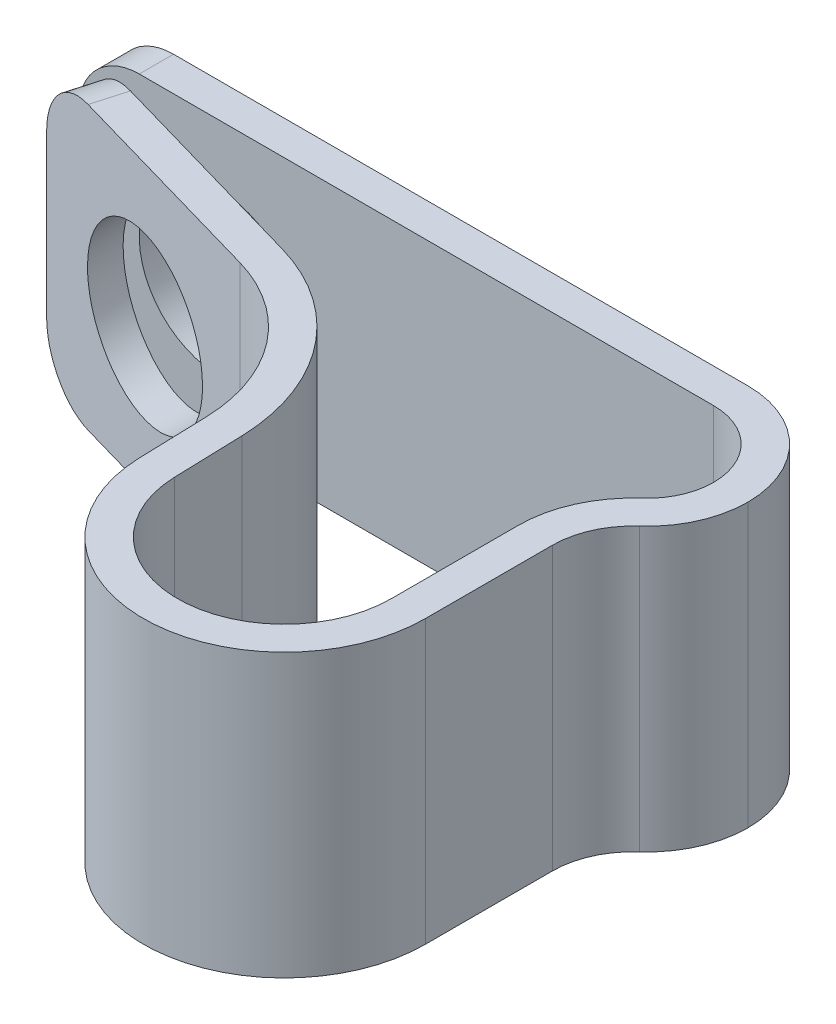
ISO-10303-21;
HEADER;
FILE_DESCRIPTION(('STEP AP214'),'2;1');
FILE_NAME('part.step','',(''),(''),'','','');
FILE_SCHEMA(('AUTOMOTIVE_DESIGN { 1 0 10303 214 1 1 1 1 }'));
ENDSEC;
DATA;
#1=APPLICATION_CONTEXT('core data for automotive mechanical design processes');
#2=APPLICATION_PROTOCOL_DEFINITION('international standard','automotive_design',2000,#1);
#3=PRODUCT_CONTEXT('',#1,'mechanical');
#4=PRODUCT('Part','Part','',(#3));
#5=PRODUCT_RELATED_PRODUCT_CATEGORY('part','',(#4));
#6=PRODUCT_DEFINITION_FORMATION('','',#4);
#7=PRODUCT_DEFINITION_CONTEXT('part definition',#1,'design');
#8=PRODUCT_DEFINITION('design','',#6,#7);
#9=PRODUCT_DEFINITION_SHAPE('','',#8);
#10=(LENGTH_UNIT() NAMED_UNIT(*) SI_UNIT(.MILLI.,.METRE.));
#11=(NAMED_UNIT(*) PLANE_ANGLE_UNIT() SI_UNIT($,.RADIAN.));
#12=(NAMED_UNIT(*) SI_UNIT($,.STERADIAN.) SOLID_ANGLE_UNIT());
#13=UNCERTAINTY_MEASURE_WITH_UNIT(LENGTH_MEASURE(1.E-05),#10,'distance_accuracy_value','');
#14=(GEOMETRIC_REPRESENTATION_CONTEXT(3) GLOBAL_UNCERTAINTY_ASSIGNED_CONTEXT((#13)) GLOBAL_UNIT_ASSIGNED_CONTEXT((#10,
#11,#12)) REPRESENTATION_CONTEXT('',''));
#15=CARTESIAN_POINT('',(0.,0.,0.));
#16=DIRECTION('',(0.,0.,1.));
#17=DIRECTION('',(1.,0.,0.));
#18=AXIS2_PLACEMENT_3D('',#15,#16,#17);
#19=CARTESIAN_POINT('',(-26.7541746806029,-46.2541746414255,1.59760957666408E-13));
#20=DIRECTION('',(1.,0.,0.));
#21=DIRECTION('',(0.,0.,-1.));
#22=AXIS2_PLACEMENT_3D('',#19,#20,#21);
#23=PLANE('',#22);
#24=DIRECTION('',(0.,-1.,0.));
#25=VECTOR('',#24,1.);
#26=CARTESIAN_POINT('',(-26.7541746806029,-46.2541746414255,0.850000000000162));
#27=LINE('',#26,#25);
#28=CARTESIAN_POINT('',(-26.7541746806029,-47.7541746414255,0.850000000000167));
#29=VERTEX_POINT('',#28);
#30=CARTESIAN_POINT('',(-26.7541746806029,-51.7541746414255,0.850000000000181));
#31=VERTEX_POINT('',#30);
#32=EDGE_CURVE('E208',#29,#31,#27,.T.);
#33=ORIENTED_EDGE('',*,*,#32,.F.);
#34=DIRECTION('',(0.,0.,1.));
#35=VECTOR('',#34,1.);
#36=CARTESIAN_POINT('',(-26.7541746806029,-47.7541746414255,1.64798730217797E-13));
#37=LINE('',#36,#35);
#38=CARTESIAN_POINT('',(-26.7541746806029,-47.7541746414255,1.64998182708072E-13));
#39=VERTEX_POINT('',#38);
#40=EDGE_CURVE('E49',#29,#39,#37,.F.);
#41=ORIENTED_EDGE('',*,*,#40,.T.);
#42=DIRECTION('',(0.,-1.,0.));
#43=VECTOR('',#42,1.);
#44=CARTESIAN_POINT('',(-26.7541746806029,-46.2541746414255,1.59760957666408E-13));
#45=LINE('',#44,#43);
#46=CARTESIAN_POINT('',(-26.7541746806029,-51.7541746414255,1.78964116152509E-13));
#47=VERTEX_POINT('',#46);
#48=EDGE_CURVE('E288',#39,#47,#45,.T.);
#49=ORIENTED_EDGE('',*,*,#48,.T.);
#50=DIRECTION('',(0.,0.,1.));
#51=VECTOR('',#50,1.);
#52=CARTESIAN_POINT('',(-26.7541746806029,-51.7541746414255,1.78964116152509E-13));
#53=LINE('',#52,#51);
#54=EDGE_CURVE('E366',#47,#31,#53,.T.);
#55=ORIENTED_EDGE('',*,*,#54,.T.);
#56=EDGE_LOOP('',(#33,#41,#49,#55));
#57=FACE_BOUND('',#56,.T.);
#58=ADVANCED_FACE('F29',(#57),#23,.F.);
#59=CARTESIAN_POINT('',(-26.7541746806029,-46.2541746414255,0.850000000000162));
#60=DIRECTION('',(0.,0.,-1.));
#61=DIRECTION('',(0.,1.,0.));
#62=AXIS2_PLACEMENT_3D('',#59,#60,#61);
#63=PLANE('',#62);
#64=CARTESIAN_POINT('',(-23.2541746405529,-49.7541746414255,0.850000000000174));
#65=DIRECTION('',(0.,0.,-1.));
#66=DIRECTION('',(0.,1.,0.));
#67=AXIS2_PLACEMENT_3D('',#64,#65,#66);
#68=CIRCLE('',#67,2.00000000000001);
#69=CARTESIAN_POINT('',(-23.2541746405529,-47.7541746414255,0.850000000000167));
#70=VERTEX_POINT('',#69);
#71=EDGE_CURVE('E201',#70,#70,#68,.T.);
#72=ORIENTED_EDGE('',*,*,#71,.T.);
#73=EDGE_LOOP('',(#72));
#74=FACE_BOUND('',#73,.T.);
#75=DIRECTION('',(1.,0.,0.));
#76=VECTOR('',#75,1.);
#77=CARTESIAN_POINT('',(-26.7541746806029,-46.2541746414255,0.850000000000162));
#78=LINE('',#77,#76);
#79=CARTESIAN_POINT('',(-25.2541746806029,-46.2541746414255,0.850000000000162));
#80=VERTEX_POINT('',#79);
#81=CARTESIAN_POINT('',(-11.0041746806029,-46.2541746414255,0.85000000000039));
#82=VERTEX_POINT('',#81);
#83=EDGE_CURVE('E251',#80,#82,#78,.T.);
#84=ORIENTED_EDGE('',*,*,#83,.F.);
#85=CARTESIAN_POINT('',(-25.2541746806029,-47.7541746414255,0.850000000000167));
#86=DIRECTION('',(0.,0.,-1.));
#87=DIRECTION('',(0.,1.,0.));
#88=AXIS2_PLACEMENT_3D('',#85,#86,#87);
#89=CIRCLE('',#88,1.5);
#90=EDGE_CURVE('E364',#80,#29,#89,.F.);
#91=ORIENTED_EDGE('',*,*,#90,.T.);
#92=ORIENTED_EDGE('',*,*,#32,.T.);
#93=CARTESIAN_POINT('',(-25.2541746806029,-51.7541746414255,0.850000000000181));
#94=DIRECTION('',(0.,0.,-1.));
#95=DIRECTION('',(0.,1.,0.));
#96=AXIS2_PLACEMENT_3D('',#93,#94,#95);
#97=CIRCLE('',#96,1.5);
#98=CARTESIAN_POINT('',(-25.2541746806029,-53.2541746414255,0.850000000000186));
#99=VERTEX_POINT('',#98);
#100=EDGE_CURVE('E196',#31,#99,#97,.F.);
#101=ORIENTED_EDGE('',*,*,#100,.T.);
#102=DIRECTION('',(1.,0.,0.));
#103=VECTOR('',#102,1.);
#104=CARTESIAN_POINT('',(-26.7541746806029,-53.2541746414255,0.850000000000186));
#105=LINE('',#104,#103);
#106=CARTESIAN_POINT('',(-11.0041746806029,-53.2541746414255,0.850000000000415));
#107=VERTEX_POINT('',#106);
#108=EDGE_CURVE('E189',#99,#107,#105,.T.);
#109=ORIENTED_EDGE('',*,*,#108,.T.);
#110=DIRECTION('',(0.,-1.,0.));
#111=VECTOR('',#110,1.);
#112=CARTESIAN_POINT('',(-11.0041746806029,-46.2541746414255,0.85000000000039));
#113=LINE('',#112,#111);
#114=EDGE_CURVE('E193',#82,#107,#113,.T.);
#115=ORIENTED_EDGE('',*,*,#114,.F.);
#116=EDGE_LOOP('',(#84,#91,#92,#101,#109,#115));
#117=FACE_BOUND('',#116,.T.);
#118=ADVANCED_FACE('F192',(#74,#117),#63,.F.);
#119=CARTESIAN_POINT('',(-11.0041746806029,-46.2541746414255,2.50000000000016));
#120=DIRECTION('',(0.,-1.,0.));
#121=DIRECTION('',(0.,0.,-1.));
#122=AXIS2_PLACEMENT_3D('',#119,#120,#121);
#123=CYLINDRICAL_SURFACE('',#122,1.64999999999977);
#124=CARTESIAN_POINT('',(-11.0041746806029,-53.2541746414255,2.50000000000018));
#125=DIRECTION('',(0.,-1.,0.));
#126=DIRECTION('',(0.,0.,1.));
#127=AXIS2_PLACEMENT_3D('',#124,#125,#126);
#128=CIRCLE('',#127,1.64999999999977);
#129=CARTESIAN_POINT('',(-9.35417468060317,-53.2541746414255,2.4999999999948));
#130=VERTEX_POINT('',#129);
#131=EDGE_CURVE('E200',#107,#130,#128,.T.);
#132=ORIENTED_EDGE('',*,*,#131,.T.);
#133=DIRECTION('',(0.,-1.,0.));
#134=VECTOR('',#133,1.);
#135=CARTESIAN_POINT('',(-9.35417468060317,-46.2541746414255,2.49999999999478));
#136=LINE('',#135,#134);
#137=CARTESIAN_POINT('',(-9.35417468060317,-46.2541746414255,2.49999999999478));
#138=VERTEX_POINT('',#137);
#139=EDGE_CURVE('E209',#138,#130,#136,.T.);
#140=ORIENTED_EDGE('',*,*,#139,.F.);
#141=CARTESIAN_POINT('',(-11.0041746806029,-46.2541746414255,2.50000000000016));
#142=DIRECTION('',(0.,-1.,0.));
#143=DIRECTION('',(0.,0.,1.));
#144=AXIS2_PLACEMENT_3D('',#141,#142,#143);
#145=CIRCLE('',#144,1.64999999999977);
#146=EDGE_CURVE('E207',#82,#138,#145,.T.);
#147=ORIENTED_EDGE('',*,*,#146,.F.);
#148=ORIENTED_EDGE('',*,*,#114,.T.);
#149=EDGE_LOOP('',(#132,#140,#147,#148));
#150=FACE_BOUND('',#149,.T.);
#151=ADVANCED_FACE('F204',(#150),#123,.F.);
#152=CARTESIAN_POINT('',(-11.0013269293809,-46.2541746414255,2.50000000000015));
#153=DIRECTION('',(0.,-1.,0.));
#154=DIRECTION('',(0.,0.,-1.));
#155=AXIS2_PLACEMENT_3D('',#152,#153,#154);
#156=CYLINDRICAL_SURFACE('',#155,1.64715224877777);
#157=CARTESIAN_POINT('',(-11.0013269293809,-53.2541746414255,2.50000000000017));
#158=DIRECTION('',(0.,-1.,0.));
#159=DIRECTION('',(0.,0.,-1.));
#160=AXIS2_PLACEMENT_3D('',#157,#158,#159);
#161=CIRCLE('',#160,1.64715224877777);
#162=CARTESIAN_POINT('',(-9.90357310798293,-53.2541746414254,3.72802568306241));
#163=VERTEX_POINT('',#162);
#164=EDGE_CURVE('E215',#130,#163,#161,.T.);
#165=ORIENTED_EDGE('',*,*,#164,.T.);
#166=DIRECTION('',(0.,-1.,0.));
#167=VECTOR('',#166,1.);
#168=CARTESIAN_POINT('',(-9.90357310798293,-46.2541746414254,3.72802568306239));
#169=LINE('',#168,#167);
#170=CARTESIAN_POINT('',(-9.90357310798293,-46.2541746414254,3.72802568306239));
#171=VERTEX_POINT('',#170);
#172=EDGE_CURVE('E335',#171,#163,#169,.T.);
#173=ORIENTED_EDGE('',*,*,#172,.F.);
#174=CARTESIAN_POINT('',(-11.0013269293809,-46.2541746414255,2.50000000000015));
#175=DIRECTION('',(0.,-1.,0.));
#176=DIRECTION('',(0.,0.,-1.));
#177=AXIS2_PLACEMENT_3D('',#174,#175,#176);
#178=CIRCLE('',#177,1.64715224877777);
#179=EDGE_CURVE('E254',#138,#171,#178,.T.);
#180=ORIENTED_EDGE('',*,*,#179,.F.);
#181=ORIENTED_EDGE('',*,*,#139,.T.);
#182=EDGE_LOOP('',(#165,#173,#180,#181));
#183=FACE_BOUND('',#182,.T.);
#184=ADVANCED_FACE('F406',(#183),#156,.F.);
#185=CARTESIAN_POINT('',(-8.00417468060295,-46.2541746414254,5.85282817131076));
#186=DIRECTION('',(0.,-1.,0.));
#187=DIRECTION('',(0.,0.,-1.));
#188=AXIS2_PLACEMENT_3D('',#185,#186,#187);
#189=CYLINDRICAL_SURFACE('',#188,2.85);
#190=CARTESIAN_POINT('',(-8.00417468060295,-53.2541746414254,5.85282817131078));
#191=DIRECTION('',(0.,1.,0.));
#192=DIRECTION('',(0.,0.,1.));
#193=AXIS2_PLACEMENT_3D('',#190,#191,#192);
#194=CIRCLE('',#193,2.85);
#195=CARTESIAN_POINT('',(-10.8541746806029,-53.2541746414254,5.85282817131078));
#196=VERTEX_POINT('',#195);
#197=EDGE_CURVE('E217',#163,#196,#194,.T.);
#198=ORIENTED_EDGE('',*,*,#197,.T.);
#199=DIRECTION('',(0.,-1.,0.));
#200=VECTOR('',#199,1.);
#201=CARTESIAN_POINT('',(-10.8541746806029,-46.2541746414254,5.85282817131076));
#202=LINE('',#201,#200);
#203=CARTESIAN_POINT('',(-10.8541746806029,-46.2541746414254,5.85282817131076));
#204=VERTEX_POINT('',#203);
#205=EDGE_CURVE('E332',#204,#196,#202,.T.);
#206=ORIENTED_EDGE('',*,*,#205,.F.);
#207=CARTESIAN_POINT('',(-8.00417468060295,-46.2541746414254,5.85282817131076));
#208=DIRECTION('',(0.,1.,0.));
#209=DIRECTION('',(0.,0.,1.));
#210=AXIS2_PLACEMENT_3D('',#207,#208,#209);
#211=CIRCLE('',#210,2.85);
#212=EDGE_CURVE('E256',#171,#204,#211,.T.);
#213=ORIENTED_EDGE('',*,*,#212,.F.);
#214=ORIENTED_EDGE('',*,*,#172,.T.);
#215=EDGE_LOOP('',(#198,#206,#213,#214));
#216=FACE_BOUND('',#215,.T.);
#217=ADVANCED_FACE('F412',(#216),#189,.T.);
#218=CARTESIAN_POINT('',(-10.8541746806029,-46.2541746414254,9.00000000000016));
#219=DIRECTION('',(1.,0.,0.));
#220=DIRECTION('',(0.,0.,-1.));
#221=AXIS2_PLACEMENT_3D('',#218,#219,#220);
#222=PLANE('',#221);
#223=DIRECTION('',(0.,0.,1.));
#224=VECTOR('',#223,1.);
#225=CARTESIAN_POINT('',(-10.8541746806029,-53.2541746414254,9.00000000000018));
#226=LINE('',#225,#224);
#227=CARTESIAN_POINT('',(-10.8541746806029,-53.2541746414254,9.00000000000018));
#228=VERTEX_POINT('',#227);
#229=EDGE_CURVE('E222',#196,#228,#226,.T.);
#230=ORIENTED_EDGE('',*,*,#229,.T.);
#231=DIRECTION('',(0.,-1.,0.));
#232=VECTOR('',#231,1.);
#233=CARTESIAN_POINT('',(-10.8541746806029,-46.2541746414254,9.00000000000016));
#234=LINE('',#233,#232);
#235=CARTESIAN_POINT('',(-10.8541746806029,-46.2541746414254,9.00000000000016));
#236=VERTEX_POINT('',#235);
#237=EDGE_CURVE('E329',#236,#228,#234,.T.);
#238=ORIENTED_EDGE('',*,*,#237,.F.);
#239=DIRECTION('',(0.,0.,1.));
#240=VECTOR('',#239,1.);
#241=CARTESIAN_POINT('',(-10.8541746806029,-46.2541746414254,9.00000000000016));
#242=LINE('',#241,#240);
#243=EDGE_CURVE('E258',#204,#236,#242,.T.);
#244=ORIENTED_EDGE('',*,*,#243,.F.);
#245=ORIENTED_EDGE('',*,*,#205,.T.);
#246=EDGE_LOOP('',(#230,#238,#244,#245));
#247=FACE_BOUND('',#246,.T.);
#248=ADVANCED_FACE('F416',(#247),#222,.F.);
#249=CARTESIAN_POINT('',(-13.5041746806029,-46.2541746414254,9.00000000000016));
#250=DIRECTION('',(0.,-1.,0.));
#251=DIRECTION('',(0.,0.,-1.));
#252=AXIS2_PLACEMENT_3D('',#249,#250,#251);
#253=CYLINDRICAL_SURFACE('',#252,2.65);
#254=CARTESIAN_POINT('',(-13.5041746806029,-53.2541746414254,9.00000000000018));
#255=DIRECTION('',(0.,-1.,0.));
#256=DIRECTION('',(0.,0.,1.));
#257=AXIS2_PLACEMENT_3D('',#254,#255,#256);
#258=CIRCLE('',#257,2.65);
#259=CARTESIAN_POINT('',(-16.1529071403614,-53.2541746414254,9.08195338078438));
#260=VERTEX_POINT('',#259);
#261=EDGE_CURVE('E224',#228,#260,#258,.T.);
#262=ORIENTED_EDGE('',*,*,#261,.T.);
#263=DIRECTION('',(0.,-1.,0.));
#264=VECTOR('',#263,1.);
#265=CARTESIAN_POINT('',(-16.1529071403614,-46.2541746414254,9.08195338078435));
#266=LINE('',#265,#264);
#267=CARTESIAN_POINT('',(-16.1529071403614,-46.2541746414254,9.08195338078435));
#268=VERTEX_POINT('',#267);
#269=EDGE_CURVE('E326',#268,#260,#266,.T.);
#270=ORIENTED_EDGE('',*,*,#269,.F.);
#271=CARTESIAN_POINT('',(-13.5041746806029,-46.2541746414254,9.00000000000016));
#272=DIRECTION('',(0.,-1.,0.));
#273=DIRECTION('',(0.,0.,1.));
#274=AXIS2_PLACEMENT_3D('',#271,#272,#273);
#275=CIRCLE('',#274,2.65);
#276=EDGE_CURVE('E260',#236,#268,#275,.T.);
#277=ORIENTED_EDGE('',*,*,#276,.F.);
#278=ORIENTED_EDGE('',*,*,#237,.T.);
#279=EDGE_LOOP('',(#262,#270,#277,#278));
#280=FACE_BOUND('',#279,.T.);
#281=ADVANCED_FACE('F420',(#280),#253,.F.);
#282=CARTESIAN_POINT('',(-16.1529071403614,-46.2541746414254,9.08195338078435));
#283=DIRECTION('',(-0.999521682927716,0.,0.0309258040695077));
#284=DIRECTION('',(0.0309258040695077,0.,0.999521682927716));
#285=AXIS2_PLACEMENT_3D('',#282,#283,#284);
#286=PLANE('',#285);
#287=DIRECTION('',(-0.0309258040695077,0.,-0.999521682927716));
#288=VECTOR('',#287,1.);
#289=CARTESIAN_POINT('',(-16.1529071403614,-53.2541746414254,9.08195338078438));
#290=LINE('',#289,#288);
#291=CARTESIAN_POINT('',(-16.2064945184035,-53.2541746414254,7.35000985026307));
#292=VERTEX_POINT('',#291);
#293=EDGE_CURVE('E226',#260,#292,#290,.T.);
#294=ORIENTED_EDGE('',*,*,#293,.T.);
#295=DIRECTION('',(0.,-1.,0.));
#296=VECTOR('',#295,1.);
#297=CARTESIAN_POINT('',(-16.2064945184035,-46.2541746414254,7.35000985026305));
#298=LINE('',#297,#296);
#299=CARTESIAN_POINT('',(-16.2064945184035,-46.2541746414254,7.35000985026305));
#300=VERTEX_POINT('',#299);
#301=EDGE_CURVE('E323',#300,#292,#298,.T.);
#302=ORIENTED_EDGE('',*,*,#301,.F.);
#303=DIRECTION('',(-0.0309258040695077,0.,-0.999521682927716));
#304=VECTOR('',#303,1.);
#305=CARTESIAN_POINT('',(-16.1529071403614,-46.2541746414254,9.08195338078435));
#306=LINE('',#305,#304);
#307=EDGE_CURVE('E262',#268,#300,#306,.T.);
#308=ORIENTED_EDGE('',*,*,#307,.F.);
#309=ORIENTED_EDGE('',*,*,#269,.T.);
#310=EDGE_LOOP('',(#294,#302,#308,#309));
#311=FACE_BOUND('',#310,.T.);
#312=ADVANCED_FACE('F424',(#311),#286,.F.);
#313=CARTESIAN_POINT('',(-21.0541746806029,-46.2541746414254,7.50000000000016));
#314=DIRECTION('',(0.,-1.,0.));
#315=DIRECTION('',(0.,0.,-1.));
#316=AXIS2_PLACEMENT_3D('',#313,#314,#315);
#317=CYLINDRICAL_SURFACE('',#316,4.85);
#318=CARTESIAN_POINT('',(-21.0541746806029,-53.2541746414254,7.50000000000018));
#319=DIRECTION('',(0.,1.,0.));
#320=DIRECTION('',(0.,0.,1.));
#321=AXIS2_PLACEMENT_3D('',#318,#319,#320);
#322=CIRCLE('',#321,4.85);
#323=CARTESIAN_POINT('',(-19.7173335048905,-53.2541746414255,2.83788077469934));
#324=VERTEX_POINT('',#323);
#325=EDGE_CURVE('E228',#292,#324,#322,.T.);
#326=ORIENTED_EDGE('',*,*,#325,.T.);
#327=DIRECTION('',(0.,-1.,0.));
#328=VECTOR('',#327,1.);
#329=CARTESIAN_POINT('',(-19.7173335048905,-46.2541746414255,2.83788077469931));
#330=LINE('',#329,#328);
#331=CARTESIAN_POINT('',(-19.7173335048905,-46.2541746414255,2.83788077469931));
#332=VERTEX_POINT('',#331);
#333=EDGE_CURVE('E320',#332,#324,#330,.T.);
#334=ORIENTED_EDGE('',*,*,#333,.F.);
#335=CARTESIAN_POINT('',(-21.0541746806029,-46.2541746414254,7.50000000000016));
#336=DIRECTION('',(0.,1.,0.));
#337=DIRECTION('',(0.,0.,1.));
#338=AXIS2_PLACEMENT_3D('',#335,#336,#337);
#339=CIRCLE('',#338,4.85);
#340=EDGE_CURVE('E264',#300,#332,#339,.T.);
#341=ORIENTED_EDGE('',*,*,#340,.F.);
#342=ORIENTED_EDGE('',*,*,#301,.T.);
#343=EDGE_LOOP('',(#326,#334,#341,#342));
#344=FACE_BOUND('',#343,.T.);
#345=ADVANCED_FACE('F428',(#344),#317,.T.);
#346=CARTESIAN_POINT('',(-19.7173335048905,-46.2541746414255,2.83788077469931));
#347=DIRECTION('',(-0.275637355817,0.,0.961261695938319));
#348=DIRECTION('',(0.961261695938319,0.,0.275637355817));
#349=AXIS2_PLACEMENT_3D('',#346,#347,#348);
#350=PLANE('',#349);
#351=CARTESIAN_POINT('',(-23.2541746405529,-49.7541746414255,1.82370789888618));
#352=DIRECTION('',(-0.275637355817,0.,0.961261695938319));
#353=DIRECTION('',(-0.961261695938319,0.,-0.275637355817));
#354=AXIS2_PLACEMENT_3D('',#351,#352,#353);
#355=ELLIPSE('',#354,2.08059887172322,2.00000000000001);
#356=CARTESIAN_POINT('',(-25.2541746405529,-49.7541746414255,1.25021712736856));
#357=VERTEX_POINT('',#356);
#358=EDGE_CURVE('E568',#357,#357,#355,.T.);
#359=ORIENTED_EDGE('',*,*,#358,.T.);
#360=EDGE_LOOP('',(#359));
#361=FACE_BOUND('',#360,.T.);
#362=DIRECTION('',(-0.961261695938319,0.,-0.275637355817));
#363=VECTOR('',#362,1.);
#364=CARTESIAN_POINT('',(-19.7173335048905,-53.2541746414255,2.83788077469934));
#365=LINE('',#364,#363);
#366=CARTESIAN_POINT('',(-24.999792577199,-53.2541746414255,1.3231600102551));
#367=VERTEX_POINT('',#366);
#368=EDGE_CURVE('E230',#324,#367,#365,.T.);
#369=ORIENTED_EDGE('',*,*,#368,.T.);
#370=CARTESIAN_POINT('',(-24.999792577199,-51.7541746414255,1.3231600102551));
#371=DIRECTION('',(-0.275637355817,0.,0.961261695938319));
#372=DIRECTION('',(0.961261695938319,0.,0.275637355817));
#373=AXIS2_PLACEMENT_3D('',#370,#371,#372);
#374=CIRCLE('',#373,1.5);
#375=CARTESIAN_POINT('',(-26.4416851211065,-51.7541746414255,0.909703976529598));
#376=VERTEX_POINT('',#375);
#377=EDGE_CURVE('E355',#367,#376,#374,.F.);
#378=ORIENTED_EDGE('',*,*,#377,.T.);
#379=DIRECTION('',(0.,-1.,0.));
#380=VECTOR('',#379,1.);
#381=CARTESIAN_POINT('',(-26.4416851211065,-46.2541746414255,0.909703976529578));
#382=LINE('',#381,#380);
#383=CARTESIAN_POINT('',(-26.4416851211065,-47.7541746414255,0.909703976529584));
#384=VERTEX_POINT('',#383);
#385=EDGE_CURVE('E317',#384,#376,#382,.T.);
#386=ORIENTED_EDGE('',*,*,#385,.F.);
#387=CARTESIAN_POINT('',(-24.999792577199,-47.7541746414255,1.32316001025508));
#388=DIRECTION('',(-0.275637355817,0.,0.961261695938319));
#389=DIRECTION('',(0.961261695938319,0.,0.275637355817));
#390=AXIS2_PLACEMENT_3D('',#387,#388,#389);
#391=CIRCLE('',#390,1.5);
#392=CARTESIAN_POINT('',(-24.999792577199,-46.2541746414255,1.32316001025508));
#393=VERTEX_POINT('',#392);
#394=EDGE_CURVE('E353',#384,#393,#391,.F.);
#395=ORIENTED_EDGE('',*,*,#394,.T.);
#396=DIRECTION('',(-0.961261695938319,0.,-0.275637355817));
#397=VECTOR('',#396,1.);
#398=CARTESIAN_POINT('',(-19.7173335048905,-46.2541746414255,2.83788077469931));
#399=LINE('',#398,#397);
#400=EDGE_CURVE('E266',#332,#393,#399,.T.);
#401=ORIENTED_EDGE('',*,*,#400,.F.);
#402=ORIENTED_EDGE('',*,*,#333,.T.);
#403=EDGE_LOOP('',(#369,#378,#386,#395,#401,#402));
#404=FACE_BOUND('',#403,.T.);
#405=ADVANCED_FACE('F432',(#361,#404),#350,.F.);
#406=CARTESIAN_POINT('',(-26.4416851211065,-46.2541746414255,0.909703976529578));
#407=DIRECTION('',(0.961261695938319,0.,0.275637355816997));
#408=DIRECTION('',(0.275637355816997,0.,-0.96126169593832));
#409=AXIS2_PLACEMENT_3D('',#406,#407,#408);
#410=PLANE('',#409);
#411=ORIENTED_EDGE('',*,*,#385,.T.);
#412=DIRECTION('',(-0.275637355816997,0.,0.96126169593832));
#413=VECTOR('',#412,1.);
#414=CARTESIAN_POINT('',(-26.4416851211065,-51.7541746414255,0.909703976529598));
#415=LINE('',#414,#413);
#416=CARTESIAN_POINT('',(-26.675976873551,-51.7541746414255,1.72677641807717));
#417=VERTEX_POINT('',#416);
#418=EDGE_CURVE('E342',#376,#417,#415,.T.);
#419=ORIENTED_EDGE('',*,*,#418,.T.);
#420=DIRECTION('',(0.,-1.,0.));
#421=VECTOR('',#420,1.);
#422=CARTESIAN_POINT('',(-26.675976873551,-46.2541746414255,1.72677641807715));
#423=LINE('',#422,#421);
#424=CARTESIAN_POINT('',(-26.675976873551,-47.7541746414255,1.72677641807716));
#425=VERTEX_POINT('',#424);
#426=EDGE_CURVE('E314',#425,#417,#423,.T.);
#427=ORIENTED_EDGE('',*,*,#426,.F.);
#428=DIRECTION('',(-0.275637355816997,0.,0.96126169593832));
#429=VECTOR('',#428,1.);
#430=CARTESIAN_POINT('',(-26.4416851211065,-47.7541746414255,0.909703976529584));
#431=LINE('',#430,#429);
#432=EDGE_CURVE('E340',#425,#384,#431,.F.);
#433=ORIENTED_EDGE('',*,*,#432,.T.);
#434=EDGE_LOOP('',(#411,#419,#427,#433));
#435=FACE_BOUND('',#434,.T.);
#436=ADVANCED_FACE('F436',(#435),#410,.F.);
#437=CARTESIAN_POINT('',(-26.675976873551,-46.2541746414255,1.72677641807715));
#438=DIRECTION('',(0.275637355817,0.,-0.961261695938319));
#439=DIRECTION('',(-0.961261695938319,0.,-0.275637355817));
#440=AXIS2_PLACEMENT_3D('',#437,#438,#439);
#441=PLANE('',#440);
#442=CARTESIAN_POINT('',(-23.2541746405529,-49.7541746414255,2.70796241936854));
#443=DIRECTION('',(0.275637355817,0.,-0.961261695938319));
#444=DIRECTION('',(-0.961261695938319,0.,-0.275637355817));
#445=AXIS2_PLACEMENT_3D('',#442,#443,#444);
#446=ELLIPSE('',#445,2.08059887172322,2.00000000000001);
#447=CARTESIAN_POINT('',(-25.2541746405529,-49.7541746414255,2.13447164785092));
#448=VERTEX_POINT('',#447);
#449=EDGE_CURVE('E565',#448,#448,#446,.T.);
#450=ORIENTED_EDGE('',*,*,#449,.T.);
#451=EDGE_LOOP('',(#450));
#452=FACE_BOUND('',#451,.T.);
#453=ORIENTED_EDGE('',*,*,#426,.T.);
#454=CARTESIAN_POINT('',(-25.2340843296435,-51.7541746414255,2.14023245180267));
#455=DIRECTION('',(0.275637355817,0.,-0.961261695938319));
#456=DIRECTION('',(-0.961261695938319,0.,-0.275637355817));
#457=AXIS2_PLACEMENT_3D('',#454,#455,#456);
#458=CIRCLE('',#457,1.5);
#459=CARTESIAN_POINT('',(-25.2340843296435,-53.2541746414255,2.14023245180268));
#460=VERTEX_POINT('',#459);
#461=EDGE_CURVE('E347',#417,#460,#458,.F.);
#462=ORIENTED_EDGE('',*,*,#461,.T.);
#463=DIRECTION('',(0.961261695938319,0.,0.275637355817));
#464=VECTOR('',#463,1.);
#465=CARTESIAN_POINT('',(-26.675976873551,-53.2541746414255,1.72677641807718));
#466=LINE('',#465,#464);
#467=CARTESIAN_POINT('',(-19.9516252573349,-53.2541746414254,3.65495321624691));
#468=VERTEX_POINT('',#467);
#469=EDGE_CURVE('E233',#460,#468,#466,.T.);
#470=ORIENTED_EDGE('',*,*,#469,.T.);
#471=DIRECTION('',(0.,-1.,0.));
#472=VECTOR('',#471,1.);
#473=CARTESIAN_POINT('',(-19.9516252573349,-46.2541746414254,3.65495321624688));
#474=LINE('',#473,#472);
#475=CARTESIAN_POINT('',(-19.9516252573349,-46.2541746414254,3.65495321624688));
#476=VERTEX_POINT('',#475);
#477=EDGE_CURVE('E311',#476,#468,#474,.T.);
#478=ORIENTED_EDGE('',*,*,#477,.F.);
#479=DIRECTION('',(0.961261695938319,0.,0.275637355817));
#480=VECTOR('',#479,1.);
#481=CARTESIAN_POINT('',(-26.675976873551,-46.2541746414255,1.72677641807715));
#482=LINE('',#481,#480);
#483=CARTESIAN_POINT('',(-25.2340843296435,-46.2541746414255,2.14023245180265));
#484=VERTEX_POINT('',#483);
#485=EDGE_CURVE('E269',#484,#476,#482,.T.);
#486=ORIENTED_EDGE('',*,*,#485,.F.);
#487=CARTESIAN_POINT('',(-25.2340843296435,-47.7541746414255,2.14023245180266));
#488=DIRECTION('',(0.275637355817,0.,-0.961261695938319));
#489=DIRECTION('',(-0.961261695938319,0.,-0.275637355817));
#490=AXIS2_PLACEMENT_3D('',#487,#488,#489);
#491=CIRCLE('',#490,1.5);
#492=EDGE_CURVE('E345',#484,#425,#491,.F.);
#493=ORIENTED_EDGE('',*,*,#492,.T.);
#494=EDGE_LOOP('',(#453,#462,#470,#478,#486,#493));
#495=FACE_BOUND('',#494,.T.);
#496=ADVANCED_FACE('F440',(#452,#495),#441,.F.);
#497=CARTESIAN_POINT('',(-21.0541746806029,-46.2541746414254,7.50000000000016));
#498=DIRECTION('',(0.,-1.,0.));
#499=DIRECTION('',(0.,0.,-1.));
#500=AXIS2_PLACEMENT_3D('',#497,#498,#499);
#501=CYLINDRICAL_SURFACE('',#500,4.);
#502=CARTESIAN_POINT('',(-21.0541746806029,-53.2541746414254,7.50000000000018));
#503=DIRECTION('',(0.,-1.,0.));
#504=DIRECTION('',(0.,0.,1.));
#505=AXIS2_PLACEMENT_3D('',#502,#503,#504);
#506=CIRCLE('',#505,4.);
#507=CARTESIAN_POINT('',(-17.0560879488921,-53.2541746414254,7.37629678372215));
#508=VERTEX_POINT('',#507);
#509=EDGE_CURVE('E235',#468,#508,#506,.T.);
#510=ORIENTED_EDGE('',*,*,#509,.T.);
#511=DIRECTION('',(0.,-1.,0.));
#512=VECTOR('',#511,1.);
#513=CARTESIAN_POINT('',(-17.0560879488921,-46.2541746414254,7.37629678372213));
#514=LINE('',#513,#512);
#515=CARTESIAN_POINT('',(-17.0560879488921,-46.2541746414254,7.37629678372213));
#516=VERTEX_POINT('',#515);
#517=EDGE_CURVE('E308',#516,#508,#514,.T.);
#518=ORIENTED_EDGE('',*,*,#517,.F.);
#519=CARTESIAN_POINT('',(-21.0541746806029,-46.2541746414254,7.50000000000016));
#520=DIRECTION('',(0.,-1.,0.));
#521=DIRECTION('',(0.,0.,1.));
#522=AXIS2_PLACEMENT_3D('',#519,#520,#521);
#523=CIRCLE('',#522,4.);
#524=EDGE_CURVE('E271',#476,#516,#523,.T.);
#525=ORIENTED_EDGE('',*,*,#524,.F.);
#526=ORIENTED_EDGE('',*,*,#477,.T.);
#527=EDGE_LOOP('',(#510,#518,#525,#526));
#528=FACE_BOUND('',#527,.T.);
#529=ADVANCED_FACE('F444',(#528),#501,.F.);
#530=CARTESIAN_POINT('',(-17.0025005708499,-46.2541746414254,9.10824031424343));
#531=DIRECTION('',(0.999521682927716,0.,-0.0309258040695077));
#532=DIRECTION('',(-0.0309258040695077,0.,-0.999521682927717));
#533=AXIS2_PLACEMENT_3D('',#530,#531,#532);
#534=PLANE('',#533);
#535=DIRECTION('',(0.0309258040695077,0.,0.999521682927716));
#536=VECTOR('',#535,1.);
#537=CARTESIAN_POINT('',(-17.0025005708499,-53.2541746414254,9.10824031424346));
#538=LINE('',#537,#536);
#539=CARTESIAN_POINT('',(-17.0025005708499,-53.2541746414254,9.10824031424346));
#540=VERTEX_POINT('',#539);
#541=EDGE_CURVE('E237',#508,#540,#538,.T.);
#542=ORIENTED_EDGE('',*,*,#541,.T.);
#543=DIRECTION('',(0.,-1.,0.));
#544=VECTOR('',#543,1.);
#545=CARTESIAN_POINT('',(-17.0025005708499,-46.2541746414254,9.10824031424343));
#546=LINE('',#545,#544);
#547=CARTESIAN_POINT('',(-17.0025005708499,-46.2541746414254,9.10824031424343));
#548=VERTEX_POINT('',#547);
#549=EDGE_CURVE('E305',#548,#540,#546,.T.);
#550=ORIENTED_EDGE('',*,*,#549,.F.);
#551=DIRECTION('',(0.0309258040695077,0.,0.999521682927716));
#552=VECTOR('',#551,1.);
#553=CARTESIAN_POINT('',(-17.0025005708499,-46.2541746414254,9.10824031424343));
#554=LINE('',#553,#552);
#555=EDGE_CURVE('E273',#516,#548,#554,.T.);
#556=ORIENTED_EDGE('',*,*,#555,.F.);
#557=ORIENTED_EDGE('',*,*,#517,.T.);
#558=EDGE_LOOP('',(#542,#550,#556,#557));
#559=FACE_BOUND('',#558,.T.);
#560=ADVANCED_FACE('F448',(#559),#534,.F.);
#561=CARTESIAN_POINT('',(-13.5041746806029,-46.2541746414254,9.00000000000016));
#562=DIRECTION('',(0.,-1.,0.));
#563=DIRECTION('',(0.,0.,-1.));
#564=AXIS2_PLACEMENT_3D('',#561,#562,#563);
#565=CYLINDRICAL_SURFACE('',#564,3.5);
#566=CARTESIAN_POINT('',(-13.5041746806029,-53.2541746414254,9.00000000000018));
#567=DIRECTION('',(0.,1.,0.));
#568=DIRECTION('',(0.,0.,1.));
#569=AXIS2_PLACEMENT_3D('',#566,#567,#568);
#570=CIRCLE('',#569,3.5);
#571=CARTESIAN_POINT('',(-10.0041746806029,-53.2541746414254,9.00000000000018));
#572=VERTEX_POINT('',#571);
#573=EDGE_CURVE('E239',#540,#572,#570,.T.);
#574=ORIENTED_EDGE('',*,*,#573,.T.);
#575=DIRECTION('',(0.,-1.,0.));
#576=VECTOR('',#575,1.);
#577=CARTESIAN_POINT('',(-10.0041746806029,-46.2541746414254,9.00000000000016));
#578=LINE('',#577,#576);
#579=CARTESIAN_POINT('',(-10.0041746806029,-46.2541746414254,9.00000000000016));
#580=VERTEX_POINT('',#579);
#581=EDGE_CURVE('E302',#580,#572,#578,.T.);
#582=ORIENTED_EDGE('',*,*,#581,.F.);
#583=CARTESIAN_POINT('',(-13.5041746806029,-46.2541746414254,9.00000000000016));
#584=DIRECTION('',(0.,1.,0.));
#585=DIRECTION('',(0.,0.,1.));
#586=AXIS2_PLACEMENT_3D('',#583,#584,#585);
#587=CIRCLE('',#586,3.5);
#588=EDGE_CURVE('E275',#548,#580,#587,.T.);
#589=ORIENTED_EDGE('',*,*,#588,.F.);
#590=ORIENTED_EDGE('',*,*,#549,.T.);
#591=EDGE_LOOP('',(#574,#582,#589,#590));
#592=FACE_BOUND('',#591,.T.);
#593=ADVANCED_FACE('F452',(#592),#565,.T.);
#594=CARTESIAN_POINT('',(-10.0041746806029,-46.2541746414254,9.00000000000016));
#595=DIRECTION('',(-1.,0.,0.));
#596=DIRECTION('',(0.,0.,1.));
#597=AXIS2_PLACEMENT_3D('',#594,#595,#596);
#598=PLANE('',#597);
#599=DIRECTION('',(0.,0.,-1.));
#600=VECTOR('',#599,1.);
#601=CARTESIAN_POINT('',(-10.0041746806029,-53.2541746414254,9.00000000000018));
#602=LINE('',#601,#600);
#603=CARTESIAN_POINT('',(-10.0041746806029,-53.2541746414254,5.85282817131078));
#604=VERTEX_POINT('',#603);
#605=EDGE_CURVE('E241',#572,#604,#602,.T.);
#606=ORIENTED_EDGE('',*,*,#605,.T.);
#607=DIRECTION('',(0.,-1.,0.));
#608=VECTOR('',#607,1.);
#609=CARTESIAN_POINT('',(-10.0041746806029,-46.2541746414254,5.85282817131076));
#610=LINE('',#609,#608);
#611=CARTESIAN_POINT('',(-10.0041746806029,-46.2541746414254,5.85282817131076));
#612=VERTEX_POINT('',#611);
#613=EDGE_CURVE('E299',#612,#604,#610,.T.);
#614=ORIENTED_EDGE('',*,*,#613,.F.);
#615=DIRECTION('',(0.,0.,-1.));
#616=VECTOR('',#615,1.);
#617=CARTESIAN_POINT('',(-10.0041746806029,-46.2541746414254,9.00000000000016));
#618=LINE('',#617,#616);
#619=EDGE_CURVE('E277',#580,#612,#618,.T.);
#620=ORIENTED_EDGE('',*,*,#619,.F.);
#621=ORIENTED_EDGE('',*,*,#581,.T.);
#622=EDGE_LOOP('',(#606,#614,#620,#621));
#623=FACE_BOUND('',#622,.T.);
#624=ADVANCED_FACE('F456',(#623),#598,.F.);
#625=CARTESIAN_POINT('',(-8.00417468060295,-46.2541746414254,5.85282817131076));
#626=DIRECTION('',(0.,-1.,0.));
#627=DIRECTION('',(0.,0.,-1.));
#628=AXIS2_PLACEMENT_3D('',#625,#626,#627);
#629=CYLINDRICAL_SURFACE('',#628,2.);
#630=CARTESIAN_POINT('',(-8.00417468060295,-53.2541746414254,5.85282817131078));
#631=DIRECTION('',(0.,-1.,0.));
#632=DIRECTION('',(0.,0.,1.));
#633=AXIS2_PLACEMENT_3D('',#630,#631,#632);
#634=CIRCLE('',#633,2.);
#635=CARTESIAN_POINT('',(-9.33708585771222,-53.2541746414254,4.36173870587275));
#636=VERTEX_POINT('',#635);
#637=EDGE_CURVE('E243',#604,#636,#634,.T.);
#638=ORIENTED_EDGE('',*,*,#637,.T.);
#639=DIRECTION('',(0.,-1.,0.));
#640=VECTOR('',#639,1.);
#641=CARTESIAN_POINT('',(-9.33708585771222,-46.2541746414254,4.36173870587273));
#642=LINE('',#641,#640);
#643=CARTESIAN_POINT('',(-9.33708585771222,-46.2541746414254,4.36173870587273));
#644=VERTEX_POINT('',#643);
#645=EDGE_CURVE('E296',#644,#636,#642,.T.);
#646=ORIENTED_EDGE('',*,*,#645,.F.);
#647=CARTESIAN_POINT('',(-8.00417468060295,-46.2541746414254,5.85282817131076));
#648=DIRECTION('',(0.,-1.,0.));
#649=DIRECTION('',(0.,0.,1.));
#650=AXIS2_PLACEMENT_3D('',#647,#648,#649);
#651=CIRCLE('',#650,2.);
#652=EDGE_CURVE('E279',#612,#644,#651,.T.);
#653=ORIENTED_EDGE('',*,*,#652,.F.);
#654=ORIENTED_EDGE('',*,*,#613,.T.);
#655=EDGE_LOOP('',(#638,#646,#653,#654));
#656=FACE_BOUND('',#655,.T.);
#657=ADVANCED_FACE('F460',(#656),#629,.F.);
#658=CARTESIAN_POINT('',(-11.0013269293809,-46.2541746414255,2.50000000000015));
#659=DIRECTION('',(0.,-1.,0.));
#660=DIRECTION('',(0.,0.,-1.));
#661=AXIS2_PLACEMENT_3D('',#658,#659,#660);
#662=CYLINDRICAL_SURFACE('',#661,2.49715224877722);
#663=CARTESIAN_POINT('',(-11.0013269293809,-53.2541746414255,2.50000000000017));
#664=DIRECTION('',(0.,1.,0.));
#665=DIRECTION('',(0.,0.,-1.));
#666=AXIS2_PLACEMENT_3D('',#663,#664,#665);
#667=CIRCLE('',#666,2.49715224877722);
#668=CARTESIAN_POINT('',(-8.50417468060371,-53.2541746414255,2.4999999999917));
#669=VERTEX_POINT('',#668);
#670=EDGE_CURVE('E245',#636,#669,#667,.T.);
#671=ORIENTED_EDGE('',*,*,#670,.T.);
#672=DIRECTION('',(0.,-1.,0.));
#673=VECTOR('',#672,1.);
#674=CARTESIAN_POINT('',(-8.50417468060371,-46.2541746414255,2.49999999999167));
#675=LINE('',#674,#673);
#676=CARTESIAN_POINT('',(-8.50417468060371,-46.2541746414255,2.49999999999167));
#677=VERTEX_POINT('',#676);
#678=EDGE_CURVE('E293',#677,#669,#675,.T.);
#679=ORIENTED_EDGE('',*,*,#678,.F.);
#680=CARTESIAN_POINT('',(-11.0013269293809,-46.2541746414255,2.50000000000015));
#681=DIRECTION('',(0.,1.,0.));
#682=DIRECTION('',(0.,0.,-1.));
#683=AXIS2_PLACEMENT_3D('',#680,#681,#682);
#684=CIRCLE('',#683,2.49715224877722);
#685=EDGE_CURVE('E281',#644,#677,#684,.T.);
#686=ORIENTED_EDGE('',*,*,#685,.F.);
#687=ORIENTED_EDGE('',*,*,#645,.T.);
#688=EDGE_LOOP('',(#671,#679,#686,#687));
#689=FACE_BOUND('',#688,.T.);
#690=ADVANCED_FACE('F464',(#689),#662,.T.);
#691=CARTESIAN_POINT('',(-11.0041746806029,-46.2541746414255,2.50000000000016));
#692=DIRECTION('',(0.,-1.,0.));
#693=DIRECTION('',(0.,0.,-1.));
#694=AXIS2_PLACEMENT_3D('',#691,#692,#693);
#695=CYLINDRICAL_SURFACE('',#694,2.49999999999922);
#696=CARTESIAN_POINT('',(-11.0041746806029,-53.2541746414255,2.50000000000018));
#697=DIRECTION('',(0.,1.,0.));
#698=DIRECTION('',(0.,0.,1.));
#699=AXIS2_PLACEMENT_3D('',#696,#697,#698);
#700=CIRCLE('',#699,2.49999999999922);
#701=CARTESIAN_POINT('',(-11.0041746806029,-53.2541746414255,1.82466617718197E-13));
#702=VERTEX_POINT('',#701);
#703=EDGE_CURVE('E247',#669,#702,#700,.T.);
#704=ORIENTED_EDGE('',*,*,#703,.T.);
#705=DIRECTION('',(0.,-1.,0.));
#706=VECTOR('',#705,1.);
#707=CARTESIAN_POINT('',(-11.0041746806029,-46.2541746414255,1.58026234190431E-13));
#708=LINE('',#707,#706);
#709=CARTESIAN_POINT('',(-11.0041746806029,-46.2541746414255,1.58026234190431E-13));
#710=VERTEX_POINT('',#709);
#711=EDGE_CURVE('E290',#710,#702,#708,.T.);
#712=ORIENTED_EDGE('',*,*,#711,.F.);
#713=CARTESIAN_POINT('',(-11.0041746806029,-46.2541746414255,2.50000000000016));
#714=DIRECTION('',(0.,1.,0.));
#715=DIRECTION('',(0.,0.,1.));
#716=AXIS2_PLACEMENT_3D('',#713,#714,#715);
#717=CIRCLE('',#716,2.49999999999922);
#718=EDGE_CURVE('E283',#677,#710,#717,.T.);
#719=ORIENTED_EDGE('',*,*,#718,.F.);
#720=ORIENTED_EDGE('',*,*,#678,.T.);
#721=EDGE_LOOP('',(#704,#712,#719,#720));
#722=FACE_BOUND('',#721,.T.);
#723=ADVANCED_FACE('F468',(#722),#695,.T.);
#724=CARTESIAN_POINT('',(-26.7541746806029,-46.2541746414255,1.59760957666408E-13));
#725=DIRECTION('',(0.,0.,1.));
#726=DIRECTION('',(0.,-1.,0.));
#727=AXIS2_PLACEMENT_3D('',#724,#725,#726);
#728=PLANE('',#727);
#729=CARTESIAN_POINT('',(-23.2541746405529,-49.7541746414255,1.76277114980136E-13));
#730=DIRECTION('',(0.,0.,-1.));
#731=DIRECTION('',(0.,1.,0.));
#732=AXIS2_PLACEMENT_3D('',#729,#730,#731);
#733=CIRCLE('',#732,2.00000000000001);
#734=CARTESIAN_POINT('',(-23.2541746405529,-47.7541746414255,1.69294148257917E-13));
#735=VERTEX_POINT('',#734);
#736=EDGE_CURVE('E570',#735,#735,#733,.T.);
#737=ORIENTED_EDGE('',*,*,#736,.F.);
#738=EDGE_LOOP('',(#737));
#739=FACE_BOUND('',#738,.T.);
#740=ORIENTED_EDGE('',*,*,#48,.F.);
#741=CARTESIAN_POINT('',(-25.2541746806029,-47.7541746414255,1.64798730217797E-13));
#742=DIRECTION('',(0.,0.,1.));
#743=DIRECTION('',(0.,-1.,0.));
#744=AXIS2_PLACEMENT_3D('',#741,#742,#743);
#745=CIRCLE('',#744,1.5);
#746=CARTESIAN_POINT('',(-25.2541746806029,-46.2541746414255,1.59595745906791E-13));
#747=VERTEX_POINT('',#746);
#748=EDGE_CURVE('E11',#39,#747,#745,.F.);
#749=ORIENTED_EDGE('',*,*,#748,.T.);
#750=DIRECTION('',(-1.,0.,0.));
#751=VECTOR('',#750,1.);
#752=CARTESIAN_POINT('',(-26.7541746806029,-46.2541746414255,1.59760957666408E-13));
#753=LINE('',#752,#751);
#754=EDGE_CURVE('E285',#710,#747,#753,.T.);
#755=ORIENTED_EDGE('',*,*,#754,.F.);
#756=ORIENTED_EDGE('',*,*,#711,.T.);
#757=DIRECTION('',(-1.,0.,0.));
#758=VECTOR('',#757,1.);
#759=CARTESIAN_POINT('',(-26.7541746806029,-53.2541746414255,1.84201341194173E-13));
#760=LINE('',#759,#758);
#761=CARTESIAN_POINT('',(-25.2541746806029,-53.2541746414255,1.84036129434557E-13));
#762=VERTEX_POINT('',#761);
#763=EDGE_CURVE('E249',#702,#762,#760,.T.);
#764=ORIENTED_EDGE('',*,*,#763,.T.);
#765=CARTESIAN_POINT('',(-25.2541746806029,-51.7541746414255,1.78798904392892E-13));
#766=DIRECTION('',(0.,0.,1.));
#767=DIRECTION('',(0.,-1.,0.));
#768=AXIS2_PLACEMENT_3D('',#765,#766,#767);
#769=CIRCLE('',#768,1.5);
#770=EDGE_CURVE('E36',#762,#47,#769,.F.);
#771=ORIENTED_EDGE('',*,*,#770,.T.);
#772=EDGE_LOOP('',(#740,#749,#755,#756,#764,#771));
#773=FACE_BOUND('',#772,.T.);
#774=ADVANCED_FACE('F380',(#739,#773),#728,.F.);
#775=CARTESIAN_POINT('',(-11.0041746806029,-46.2541746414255,2.50000000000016));
#776=DIRECTION('',(0.,1.,0.));
#777=DIRECTION('',(0.,0.,1.));
#778=AXIS2_PLACEMENT_3D('',#775,#776,#777);
#779=PLANE('',#778);
#780=ORIENTED_EDGE('',*,*,#400,.T.);
#781=DIRECTION('',(-0.275637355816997,0.,0.96126169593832));
#782=VECTOR('',#781,1.);
#783=CARTESIAN_POINT('',(-25.2340843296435,-46.2541746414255,2.14023245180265));
#784=LINE('',#783,#782);
#785=EDGE_CURVE('E360',#393,#484,#784,.T.);
#786=ORIENTED_EDGE('',*,*,#785,.T.);
#787=ORIENTED_EDGE('',*,*,#485,.T.);
#788=ORIENTED_EDGE('',*,*,#524,.T.);
#789=ORIENTED_EDGE('',*,*,#555,.T.);
#790=ORIENTED_EDGE('',*,*,#588,.T.);
#791=ORIENTED_EDGE('',*,*,#619,.T.);
#792=ORIENTED_EDGE('',*,*,#652,.T.);
#793=ORIENTED_EDGE('',*,*,#685,.T.);
#794=ORIENTED_EDGE('',*,*,#718,.T.);
#795=ORIENTED_EDGE('',*,*,#754,.T.);
#796=DIRECTION('',(0.,0.,1.));
#797=VECTOR('',#796,1.);
#798=CARTESIAN_POINT('',(-25.2541746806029,-46.2541746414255,0.850000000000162));
#799=LINE('',#798,#797);
#800=EDGE_CURVE('E357',#747,#80,#799,.T.);
#801=ORIENTED_EDGE('',*,*,#800,.T.);
#802=ORIENTED_EDGE('',*,*,#83,.T.);
#803=ORIENTED_EDGE('',*,*,#146,.T.);
#804=ORIENTED_EDGE('',*,*,#179,.T.);
#805=ORIENTED_EDGE('',*,*,#212,.T.);
#806=ORIENTED_EDGE('',*,*,#243,.T.);
#807=ORIENTED_EDGE('',*,*,#276,.T.);
#808=ORIENTED_EDGE('',*,*,#307,.T.);
#809=ORIENTED_EDGE('',*,*,#340,.T.);
#810=EDGE_LOOP('',(#780,#786,#787,#788,#789,#790,#791,#792,#793,#794,#795,#801,#802,#803,#804,
#805,#806,#807,#808,#809));
#811=FACE_BOUND('',#810,.T.);
#812=ADVANCED_FACE('F376',(#811),#779,.T.);
#813=CARTESIAN_POINT('',(-11.0041746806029,-53.2541746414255,2.50000000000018));
#814=DIRECTION('',(0.,1.,0.));
#815=DIRECTION('',(0.,0.,1.));
#816=AXIS2_PLACEMENT_3D('',#813,#814,#815);
#817=PLANE('',#816);
#818=ORIENTED_EDGE('',*,*,#469,.F.);
#819=DIRECTION('',(-0.275637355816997,0.,0.96126169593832));
#820=VECTOR('',#819,1.);
#821=CARTESIAN_POINT('',(-24.2482772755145,-53.2541746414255,-1.29768530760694));
#822=LINE('',#821,#820);
#823=EDGE_CURVE('E351',#460,#367,#822,.F.);
#824=ORIENTED_EDGE('',*,*,#823,.T.);
#825=ORIENTED_EDGE('',*,*,#368,.F.);
#826=ORIENTED_EDGE('',*,*,#325,.F.);
#827=ORIENTED_EDGE('',*,*,#293,.F.);
#828=ORIENTED_EDGE('',*,*,#261,.F.);
#829=ORIENTED_EDGE('',*,*,#229,.F.);
#830=ORIENTED_EDGE('',*,*,#197,.F.);
#831=ORIENTED_EDGE('',*,*,#164,.F.);
#832=ORIENTED_EDGE('',*,*,#131,.F.);
#833=ORIENTED_EDGE('',*,*,#108,.F.);
#834=DIRECTION('',(0.,0.,1.));
#835=VECTOR('',#834,1.);
#836=CARTESIAN_POINT('',(-25.2541746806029,-53.2541746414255,2.50000000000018));
#837=LINE('',#836,#835);
#838=EDGE_CURVE('E349',#99,#762,#837,.F.);
#839=ORIENTED_EDGE('',*,*,#838,.T.);
#840=ORIENTED_EDGE('',*,*,#763,.F.);
#841=ORIENTED_EDGE('',*,*,#703,.F.);
#842=ORIENTED_EDGE('',*,*,#670,.F.);
#843=ORIENTED_EDGE('',*,*,#637,.F.);
#844=ORIENTED_EDGE('',*,*,#605,.F.);
#845=ORIENTED_EDGE('',*,*,#573,.F.);
#846=ORIENTED_EDGE('',*,*,#541,.F.);
#847=ORIENTED_EDGE('',*,*,#509,.F.);
#848=EDGE_LOOP('',(#818,#824,#825,#826,#827,#828,#829,#830,#831,#832,#833,#839,#840,#841,#842,
#843,#844,#845,#846,#847));
#849=FACE_BOUND('',#848,.T.);
#850=ADVANCED_FACE('F213',(#849),#817,.F.);
#851=CARTESIAN_POINT('',(-24.999792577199,-51.7541746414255,1.32316001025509));
#852=DIRECTION('',(-0.275637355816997,0.,0.96126169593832));
#853=DIRECTION('',(0.961261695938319,0.,0.275637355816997));
#854=AXIS2_PLACEMENT_3D('',#851,#852,#853);
#855=CYLINDRICAL_SURFACE('',#854,1.5);
#856=ORIENTED_EDGE('',*,*,#377,.F.);
#857=ORIENTED_EDGE('',*,*,#823,.F.);
#858=ORIENTED_EDGE('',*,*,#461,.F.);
#859=ORIENTED_EDGE('',*,*,#418,.F.);
#860=EDGE_LOOP('',(#856,#857,#858,#859));
#861=FACE_BOUND('',#860,.T.);
#862=ADVANCED_FACE('F479',(#861),#855,.T.);
#863=CARTESIAN_POINT('',(-24.2482772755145,-47.7541746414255,-1.29768530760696));
#864=DIRECTION('',(0.275637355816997,0.,-0.96126169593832));
#865=DIRECTION('',(-0.961261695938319,0.,-0.275637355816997));
#866=AXIS2_PLACEMENT_3D('',#863,#864,#865);
#867=CYLINDRICAL_SURFACE('',#866,1.5);
#868=ORIENTED_EDGE('',*,*,#394,.F.);
#869=ORIENTED_EDGE('',*,*,#432,.F.);
#870=ORIENTED_EDGE('',*,*,#492,.F.);
#871=ORIENTED_EDGE('',*,*,#785,.F.);
#872=EDGE_LOOP('',(#868,#869,#870,#871));
#873=FACE_BOUND('',#872,.T.);
#874=ADVANCED_FACE('F396',(#873),#867,.T.);
#875=CARTESIAN_POINT('',(-25.2541746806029,-47.7541746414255,2.50000000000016));
#876=DIRECTION('',(0.,0.,-1.));
#877=DIRECTION('',(0.,1.,0.));
#878=AXIS2_PLACEMENT_3D('',#875,#876,#877);
#879=CYLINDRICAL_SURFACE('',#878,1.5);
#880=ORIENTED_EDGE('',*,*,#748,.F.);
#881=ORIENTED_EDGE('',*,*,#40,.F.);
#882=ORIENTED_EDGE('',*,*,#90,.F.);
#883=ORIENTED_EDGE('',*,*,#800,.F.);
#884=EDGE_LOOP('',(#880,#881,#882,#883));
#885=FACE_BOUND('',#884,.T.);
#886=ADVANCED_FACE('F374',(#885),#879,.T.);
#887=CARTESIAN_POINT('',(-25.2541746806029,-51.7541746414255,1.78964116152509E-13));
#888=DIRECTION('',(0.,0.,1.));
#889=DIRECTION('',(0.,-1.,0.));
#890=AXIS2_PLACEMENT_3D('',#887,#888,#889);
#891=CYLINDRICAL_SURFACE('',#890,1.5);
#892=ORIENTED_EDGE('',*,*,#770,.F.);
#893=ORIENTED_EDGE('',*,*,#838,.F.);
#894=ORIENTED_EDGE('',*,*,#100,.F.);
#895=ORIENTED_EDGE('',*,*,#54,.F.);
#896=EDGE_LOOP('',(#892,#893,#894,#895));
#897=FACE_BOUND('',#896,.T.);
#898=ADVANCED_FACE('F385',(#897),#891,.T.);
#899=CARTESIAN_POINT('',(-23.2541746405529,-49.7541746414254,10.0000000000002));
#900=DIRECTION('',(0.,0.,-1.));
#901=DIRECTION('',(0.,1.,0.));
#902=AXIS2_PLACEMENT_3D('',#899,#900,#901);
#903=CYLINDRICAL_SURFACE('',#902,2.00000000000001);
#904=ORIENTED_EDGE('',*,*,#736,.T.);
#905=EDGE_LOOP('',(#904));
#906=FACE_BOUND('',#905,.T.);
#907=ORIENTED_EDGE('',*,*,#71,.F.);
#908=EDGE_LOOP('',(#907));
#909=FACE_BOUND('',#908,.T.);
#910=ADVANCED_FACE('F387',(#906,#909),#903,.F.);
#911=ORIENTED_EDGE('',*,*,#449,.F.);
#912=EDGE_LOOP('',(#911));
#913=FACE_BOUND('',#912,.T.);
#914=ORIENTED_EDGE('',*,*,#358,.F.);
#915=EDGE_LOOP('',(#914));
#916=FACE_BOUND('',#915,.T.);
#917=ADVANCED_FACE('F393',(#913,#916),#903,.F.);
#918=CLOSED_SHELL('',(#58,#118,#151,#184,#217,#248,#281,#312,#345,#405,#436,#496,#529,#560,#593,
#624,#657,#690,#723,#774,#812,#850,#862,#874,#886,#898,#910,#917));
#919=MANIFOLD_SOLID_BREP('B2',#918);
#920=ADVANCED_BREP_SHAPE_REPRESENTATION('',(#18,#919),#14);
#921=SHAPE_DEFINITION_REPRESENTATION(#9,#920);
ENDSEC;
END-ISO-10303-21;
